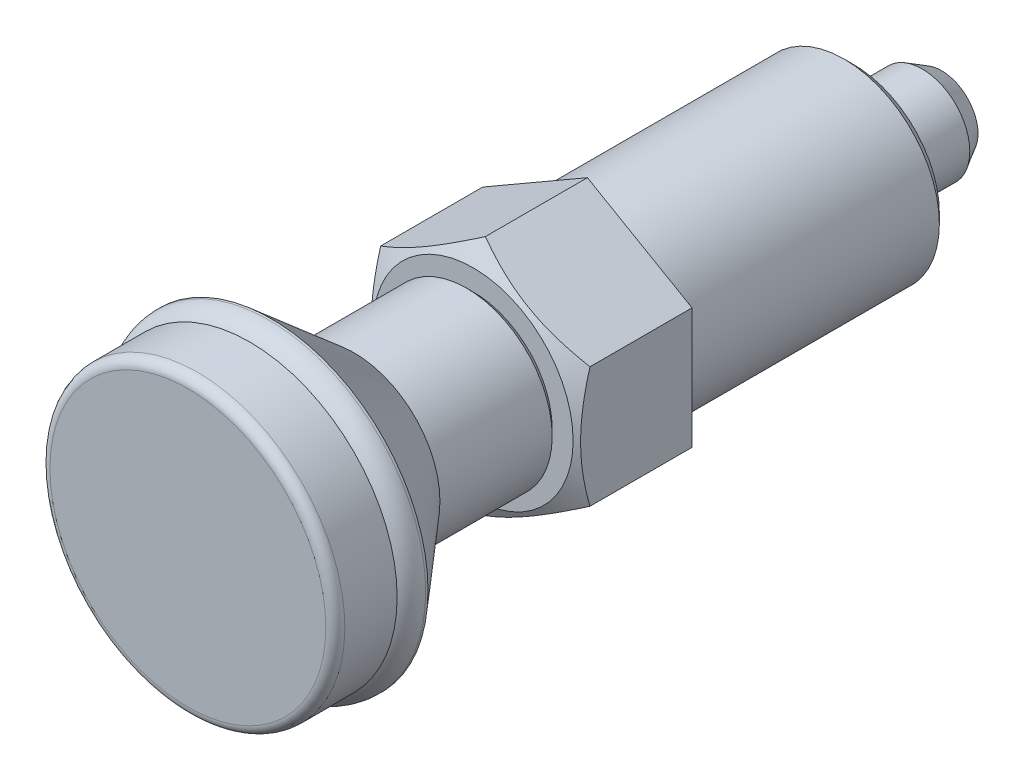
ISO-10303-21;
HEADER;
FILE_DESCRIPTION(('STEP AP214'),'2;1');
FILE_NAME('part.step','',(''),(''),'','','');
FILE_SCHEMA(('AUTOMOTIVE_DESIGN { 1 0 10303 214 1 1 1 1 }'));
ENDSEC;
DATA;
#1=APPLICATION_CONTEXT('core data for automotive mechanical design processes');
#2=APPLICATION_PROTOCOL_DEFINITION('international standard','automotive_design',2000,#1);
#3=PRODUCT_CONTEXT('',#1,'mechanical');
#4=PRODUCT('Part','Part','',(#3));
#5=PRODUCT_RELATED_PRODUCT_CATEGORY('part','',(#4));
#6=PRODUCT_DEFINITION_FORMATION('','',#4);
#7=PRODUCT_DEFINITION_CONTEXT('part definition',#1,'design');
#8=PRODUCT_DEFINITION('design','',#6,#7);
#9=PRODUCT_DEFINITION_SHAPE('','',#8);
#10=(LENGTH_UNIT() NAMED_UNIT(*) SI_UNIT(.MILLI.,.METRE.));
#11=(NAMED_UNIT(*) PLANE_ANGLE_UNIT() SI_UNIT($,.RADIAN.));
#12=(NAMED_UNIT(*) SI_UNIT($,.STERADIAN.) SOLID_ANGLE_UNIT());
#13=UNCERTAINTY_MEASURE_WITH_UNIT(LENGTH_MEASURE(1.E-05),#10,'distance_accuracy_value','');
#14=(GEOMETRIC_REPRESENTATION_CONTEXT(3) GLOBAL_UNCERTAINTY_ASSIGNED_CONTEXT((#13)) GLOBAL_UNIT_ASSIGNED_CONTEXT((#10,
#11,#12)) REPRESENTATION_CONTEXT('',''));
#15=CARTESIAN_POINT('',(0.,0.,0.));
#16=DIRECTION('',(0.,0.,1.));
#17=DIRECTION('',(1.,0.,0.));
#18=AXIS2_PLACEMENT_3D('',#15,#16,#17);
#19=CARTESIAN_POINT('',(-1.94607460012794E-12,1.11855633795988E-12,12.));
#20=DIRECTION('',(1.62172883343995E-13,0.,-1.));
#21=DIRECTION('',(-1.,0.,-1.62172883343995E-13));
#22=AXIS2_PLACEMENT_3D('',#19,#20,#21);
#23=CONICAL_SURFACE('',#22,10.499999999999,1.0471975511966);
#24=CARTESIAN_POINT('',(-1.94607460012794E-12,1.11855633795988E-12,12.));
#25=DIRECTION('',(-1.62172883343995E-13,0.,1.));
#26=DIRECTION('',(1.,0.,1.62172883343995E-13));
#27=AXIS2_PLACEMENT_3D('',#24,#25,#26);
#28=CIRCLE('',#27,10.499999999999);
#29=CARTESIAN_POINT('',(10.4999999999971,1.11855633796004E-12,12.0000000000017));
#30=VERTEX_POINT('',#29);
#31=EDGE_CURVE('E235',#30,#30,#28,.T.);
#32=ORIENTED_EDGE('',*,*,#31,.F.);
#33=EDGE_LOOP('',(#32));
#34=FACE_BOUND('',#33,.T.);
#35=CARTESIAN_POINT('',(11.0001999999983,6.35073749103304,10.7287778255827));
#36=CARTESIAN_POINT('',(10.7583962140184,6.49034297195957,10.8093657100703));
#37=CARTESIAN_POINT('',(10.5156908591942,6.63046897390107,10.8862959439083));
#38=CARTESIAN_POINT('',(10.0283338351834,6.91184468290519,11.031826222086));
#39=CARTESIAN_POINT('',(9.78368155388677,7.05309474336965,11.100423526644));
#40=CARTESIAN_POINT('',(9.04578263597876,7.47912088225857,11.2923885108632));
#41=CARTESIAN_POINT('',(8.5496230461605,7.76557875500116,11.4015771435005));
#42=CARTESIAN_POINT('',(7.80714296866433,8.1942498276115,11.5296107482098));
#43=CARTESIAN_POINT('',(7.56304065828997,8.33518236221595,11.5660826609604));
#44=CARTESIAN_POINT('',(7.07370581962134,8.61769996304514,11.627243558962));
#45=CARTESIAN_POINT('',(6.82847326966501,8.75928504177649,11.6519323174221));
#46=CARTESIAN_POINT('',(6.33759931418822,9.04269125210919,11.688894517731));
#47=CARTESIAN_POINT('',(6.09195874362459,9.184511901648,11.7011827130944));
#48=CARTESIAN_POINT('',(5.60044998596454,9.46828461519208,11.7130819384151));
#49=CARTESIAN_POINT('',(5.35458180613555,9.61023667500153,11.7126933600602));
#50=CARTESIAN_POINT('',(4.89492981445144,9.87561687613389,11.7001236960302));
#51=CARTESIAN_POINT('',(4.68111322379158,9.99906394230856,11.6894758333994));
#52=CARTESIAN_POINT('',(4.25397181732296,10.2456741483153,11.6587932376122));
#53=CARTESIAN_POINT('',(4.04064703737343,10.3688372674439,11.6387578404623));
#54=CARTESIAN_POINT('',(3.61460518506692,10.6148126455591,11.5896494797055));
#55=CARTESIAN_POINT('',(3.40188876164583,10.7376245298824,11.5605690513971));
#56=CARTESIAN_POINT('',(2.97745318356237,10.9826725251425,11.4938808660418));
#57=CARTESIAN_POINT('',(2.76573409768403,11.1049085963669,11.4562725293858));
#58=CARTESIAN_POINT('',(2.12304886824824,11.4759630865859,11.3297049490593));
#59=CARTESIAN_POINT('',(1.69394387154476,11.7237069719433,11.2281254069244));
#60=CARTESIAN_POINT('',(0.842132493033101,12.2155005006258,10.9975811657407));
#61=CARTESIAN_POINT('',(0.419415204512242,12.4595564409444,10.868670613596));
#62=CARTESIAN_POINT('',(-0.000200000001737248,12.7018213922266,10.7287778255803));
#63=B_SPLINE_CURVE_WITH_KNOTS('',3,(#35,#36,#37,#38,#39,#40,#41,#42,#43,#44,#45,#46,#47,#48,#49,
#50,#51,#52,#53,#54,#55,#56,#57,#58,#59,#60,#61,#62),.UNSPECIFIED.,.F.,.F.,(4,2,2,2,2,2,2,2,2,2,
2,2,2,4),(0.,0.8717551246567,1.74379610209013,3.49159027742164,4.34403665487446,
5.19649943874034,6.04794680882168,6.89936787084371,7.64056020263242,8.38180496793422,
9.12366309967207,9.865571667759,11.3820155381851,12.8954827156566),.UNSPECIFIED.);
#64=CARTESIAN_POINT('',(10.9999999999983,6.35085296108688,10.728844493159));
#65=VERTEX_POINT('',#64);
#66=CARTESIAN_POINT('',(0.,12.7017059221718,10.7288444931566));
#67=VERTEX_POINT('',#66);
#68=EDGE_CURVE('E85',#65,#67,#63,.T.);
#69=ORIENTED_EDGE('',*,*,#68,.T.);
#70=CARTESIAN_POINT('',(0.000199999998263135,12.7018213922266,10.7287778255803));
#71=CARTESIAN_POINT('',(-0.241603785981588,12.5622159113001,10.8093657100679));
#72=CARTESIAN_POINT('',(-0.484309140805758,12.4220899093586,10.886295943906));
#73=CARTESIAN_POINT('',(-0.971666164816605,12.1407142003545,11.0318262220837));
#74=CARTESIAN_POINT('',(-1.21631844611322,11.9994641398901,11.1004235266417));
#75=CARTESIAN_POINT('',(-1.95421736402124,11.5734380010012,11.292388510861));
#76=CARTESIAN_POINT('',(-2.4503769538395,11.2869801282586,11.4015771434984));
#77=CARTESIAN_POINT('',(-3.19285703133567,10.8583090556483,11.5296107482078));
#78=CARTESIAN_POINT('',(-3.43695934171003,10.7173765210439,11.5660826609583));
#79=CARTESIAN_POINT('',(-3.92629418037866,10.4348589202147,11.62724355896));
#80=CARTESIAN_POINT('',(-4.17152673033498,10.2932738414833,11.6519323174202));
#81=CARTESIAN_POINT('',(-4.66240068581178,10.0098676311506,11.6888945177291));
#82=CARTESIAN_POINT('',(-4.90804125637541,9.86804698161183,11.7011827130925));
#83=CARTESIAN_POINT('',(-5.39955001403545,9.58427426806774,11.7130819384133));
#84=CARTESIAN_POINT('',(-5.64541819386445,9.44232220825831,11.7126933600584));
#85=CARTESIAN_POINT('',(-6.10507018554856,9.17694200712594,11.7001236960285));
#86=CARTESIAN_POINT('',(-6.31888677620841,9.05349494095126,11.6894758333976));
#87=CARTESIAN_POINT('',(-6.74602818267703,8.80688473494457,11.6587932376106));
#88=CARTESIAN_POINT('',(-6.95935296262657,8.68372161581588,11.6387578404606));
#89=CARTESIAN_POINT('',(-7.38539481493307,8.43774623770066,11.5896494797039));
#90=CARTESIAN_POINT('',(-7.59811123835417,8.31493435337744,11.5605690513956));
#91=CARTESIAN_POINT('',(-8.02254681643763,8.06988635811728,11.4938808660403));
#92=CARTESIAN_POINT('',(-8.23426590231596,7.94765028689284,11.4562725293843));
#93=CARTESIAN_POINT('',(-8.87695113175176,7.57659579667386,11.3297049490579));
#94=CARTESIAN_POINT('',(-9.30605612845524,7.32885191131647,11.2281254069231));
#95=CARTESIAN_POINT('',(-10.1578675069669,6.83705838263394,10.9975811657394));
#96=CARTESIAN_POINT('',(-10.5805847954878,6.59300244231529,10.8686706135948));
#97=CARTESIAN_POINT('',(-11.0002000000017,6.35073749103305,10.7287778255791));
#98=B_SPLINE_CURVE_WITH_KNOTS('',3,(#70,#71,#72,#73,#74,#75,#76,#77,#78,#79,#80,#81,#82,#83,#84,
#85,#86,#87,#88,#89,#90,#91,#92,#93,#94,#95,#96,#97),.UNSPECIFIED.,.F.,.F.,(4,2,2,2,2,2,2,2,2,2,
2,2,2,4),(0.,0.871755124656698,1.74379610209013,3.49159027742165,4.34403665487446,
5.19649943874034,6.04794680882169,6.89936787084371,7.64056020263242,8.38180496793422,
9.12366309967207,9.865571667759,11.3820155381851,12.8954827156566),.UNSPECIFIED.);
#99=CARTESIAN_POINT('',(-11.0000000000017,6.35085296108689,10.7288444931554));
#100=VERTEX_POINT('',#99);
#101=EDGE_CURVE('E75',#67,#100,#98,.T.);
#102=ORIENTED_EDGE('',*,*,#101,.T.);
#103=CARTESIAN_POINT('',(-11.000000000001,-16.8033913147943,6.46686326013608));
#104=CARTESIAN_POINT('',(-11.0000000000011,-16.5620742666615,6.58342928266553));
#105=CARTESIAN_POINT('',(-11.0000000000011,-16.3204643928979,6.6993887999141));
#106=CARTESIAN_POINT('',(-11.0000000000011,-15.8365971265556,6.92995551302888));
#107=CARTESIAN_POINT('',(-11.0000000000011,-15.5943397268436,7.04456269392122));
#108=CARTESIAN_POINT('',(-11.0000000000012,-14.8664318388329,7.38618027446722));
#109=CARTESIAN_POINT('',(-11.0000000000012,-14.3797248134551,7.61094836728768));
#110=CARTESIAN_POINT('',(-11.0000000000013,-13.4001281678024,8.05434060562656));
#111=CARTESIAN_POINT('',(-11.0000000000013,-12.9072190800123,8.27292185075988));
#112=CARTESIAN_POINT('',(-11.0000000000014,-11.9173356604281,8.70064166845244));
#113=CARTESIAN_POINT('',(-11.0000000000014,-11.4203615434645,8.90978073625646));
#114=CARTESIAN_POINT('',(-11.0000000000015,-10.4155733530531,9.31850427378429));
#115=CARTESIAN_POINT('',(-11.0000000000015,-9.90770066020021,9.51794543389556));
#116=CARTESIAN_POINT('',(-11.0000000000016,-8.88595211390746,9.90110782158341));
#117=CARTESIAN_POINT('',(-11.0000000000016,-8.37207559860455,10.0848272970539));
#118=CARTESIAN_POINT('',(-11.0000000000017,-7.33856431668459,10.4315794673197));
#119=CARTESIAN_POINT('',(-11.0000000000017,-6.8189445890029,10.594656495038));
#120=CARTESIAN_POINT('',(-11.0000000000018,-5.77233865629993,10.8948046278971));
#121=CARTESIAN_POINT('',(-11.0000000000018,-5.24535484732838,11.0318839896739));
#122=CARTESIAN_POINT('',(-11.0000000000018,-4.18355667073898,11.2733499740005));
#123=CARTESIAN_POINT('',(-11.0000000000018,-3.64873977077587,11.3777257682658));
#124=CARTESIAN_POINT('',(-11.0000000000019,-2.84184292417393,11.5045125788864));
#125=CARTESIAN_POINT('',(-11.0000000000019,-2.57206571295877,11.5418147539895));
#126=CARTESIAN_POINT('',(-11.0000000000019,-2.03125940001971,11.6057590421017));
#127=CARTESIAN_POINT('',(-11.0000000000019,-1.76023041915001,11.6324021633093));
#128=CARTESIAN_POINT('',(-11.0000000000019,-1.21898438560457,11.6743130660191));
#129=CARTESIAN_POINT('',(-11.0000000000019,-0.948772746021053,11.6896504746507));
#130=CARTESIAN_POINT('',(-11.0000000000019,-0.407943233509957,11.708869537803));
#131=CARTESIAN_POINT('',(-11.0000000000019,-0.137325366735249,11.712751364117));
#132=CARTESIAN_POINT('',(-11.0000000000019,0.40375541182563,11.7089669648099));
#133=CARTESIAN_POINT('',(-11.0000000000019,0.67421834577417,11.7013039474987));
#134=CARTESIAN_POINT('',(-11.0000000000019,1.21458707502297,11.6746193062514));
#135=CARTESIAN_POINT('',(-11.0000000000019,1.48449283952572,11.6555970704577));
#136=CARTESIAN_POINT('',(-11.0000000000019,2.13975155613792,11.5960223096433));
#137=CARTESIAN_POINT('',(-11.0000000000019,2.52459164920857,11.5497180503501));
#138=CARTESIAN_POINT('',(-11.0000000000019,3.29123006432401,11.4366039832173));
#139=CARTESIAN_POINT('',(-11.0000000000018,3.67302792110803,11.3697910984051));
#140=CARTESIAN_POINT('',(-11.0000000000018,4.81453751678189,11.1419434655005));
#141=CARTESIAN_POINT('',(-11.0000000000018,5.56887050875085,10.9536528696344));
#142=CARTESIAN_POINT('',(-11.0000000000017,6.69714810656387,10.6293211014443));
#143=CARTESIAN_POINT('',(-11.0000000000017,7.07699619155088,10.5126543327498));
#144=CARTESIAN_POINT('',(-11.0000000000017,7.83302288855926,10.267770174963));
#145=CARTESIAN_POINT('',(-11.0000000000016,8.20920116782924,10.1395517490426));
#146=CARTESIAN_POINT('',(-11.0000000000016,8.95600996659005,9.87430554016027));
#147=CARTESIAN_POINT('',(-11.0000000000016,9.32665982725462,9.73733166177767));
#148=CARTESIAN_POINT('',(-11.0000000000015,10.0648107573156,9.45550377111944));
#149=CARTESIAN_POINT('',(-11.0000000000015,10.4323128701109,9.31065249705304));
#150=CARTESIAN_POINT('',(-11.0000000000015,10.7984905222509,9.16260110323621));
#151=B_SPLINE_CURVE_WITH_KNOTS('',3,(#103,#104,#105,#106,#107,#108,#109,#110,#111,#112,#113,
#114,#115,#116,#117,#118,#119,#120,#121,#122,#123,#124,#125,#126,#127,#128,#129,#130,#131,#132,
#133,#134,#135,#136,#137,#138,#139,#140,#141,#142,#143,#144,#145,#146,#147,#148,#149,#150),
.UNSPECIFIED.,.F.,.F.,(4,2,2,2,2,2,2,2,2,2,2,2,2,2,2,2,2,2,2,2,2,2,2,4),(0.,0.803984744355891,
1.6079783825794,3.21622949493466,4.83375407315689,6.45119371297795,8.08788018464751,
9.72474882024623,11.3580401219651,12.990811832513,14.6241235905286,15.4409776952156,
16.2577545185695,17.0694581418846,17.8811495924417,18.6926155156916,19.504125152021,
20.6663113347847,21.8286719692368,24.1578810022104,25.3498722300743,26.5419705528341,
27.7273290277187,28.912278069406),.UNSPECIFIED.);
#152=CARTESIAN_POINT('',(-11.0000000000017,-6.35085296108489,10.7288444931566));
#153=VERTEX_POINT('',#152);
#154=EDGE_CURVE('E161',#100,#153,#151,.F.);
#155=ORIENTED_EDGE('',*,*,#154,.T.);
#156=CARTESIAN_POINT('',(-11.0002000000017,-6.35073749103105,10.7287778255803));
#157=CARTESIAN_POINT('',(-10.7583962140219,-6.49034297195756,10.809365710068));
#158=CARTESIAN_POINT('',(-10.5156908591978,-6.63046897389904,10.8862959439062));
#159=CARTESIAN_POINT('',(-10.028333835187,-6.91184468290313,11.031826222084));
#160=CARTESIAN_POINT('',(-9.78368155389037,-7.05309474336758,11.1004235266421));
#161=CARTESIAN_POINT('',(-9.04578263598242,-7.47912088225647,11.2923885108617));
#162=CARTESIAN_POINT('',(-8.5496230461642,-7.76557875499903,11.4015771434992));
#163=CARTESIAN_POINT('',(-7.80714296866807,-8.19424982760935,11.5296107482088));
#164=CARTESIAN_POINT('',(-7.56304065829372,-8.33518236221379,11.5660826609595));
#165=CARTESIAN_POINT('',(-7.07370581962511,-8.61769996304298,11.6272435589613));
#166=CARTESIAN_POINT('',(-6.82847326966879,-8.75928504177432,11.6519323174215));
#167=CARTESIAN_POINT('',(-6.33759931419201,-9.04269125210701,11.6888945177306));
#168=CARTESIAN_POINT('',(-6.09195874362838,-9.18451190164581,11.7011827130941));
#169=CARTESIAN_POINT('',(-5.60044998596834,-9.46828461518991,11.713081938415));
#170=CARTESIAN_POINT('',(-5.35458180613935,-9.61023667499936,11.7126933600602));
#171=CARTESIAN_POINT('',(-4.89492981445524,-9.87561687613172,11.7001236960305));
#172=CARTESIAN_POINT('',(-4.68111322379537,-9.99906394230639,11.6894758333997));
#173=CARTESIAN_POINT('',(-4.25397181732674,-10.2456741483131,11.6587932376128));
#174=CARTESIAN_POINT('',(-4.0406470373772,-10.3688372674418,11.6387578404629));
#175=CARTESIAN_POINT('',(-3.61460518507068,-10.614812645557,11.5896494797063));
#176=CARTESIAN_POINT('',(-3.40188876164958,-10.7376245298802,11.560569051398));
#177=CARTESIAN_POINT('',(-2.97745318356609,-10.9826725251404,11.4938808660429));
#178=CARTESIAN_POINT('',(-2.76573409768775,-11.1049085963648,11.456272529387));
#179=CARTESIAN_POINT('',(-2.12304886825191,-11.4759630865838,11.3297049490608));
#180=CARTESIAN_POINT('',(-1.6939438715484,-11.7237069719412,11.2281254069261));
#181=CARTESIAN_POINT('',(-0.842132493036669,-12.2155005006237,10.9975811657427));
#182=CARTESIAN_POINT('',(-0.419415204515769,-12.4595564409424,10.8686706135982));
#183=CARTESIAN_POINT('',(0.00019999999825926,-12.7018213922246,10.7287778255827));
#184=B_SPLINE_CURVE_WITH_KNOTS('',3,(#156,#157,#158,#159,#160,#161,#162,#163,#164,#165,#166,
#167,#168,#169,#170,#171,#172,#173,#174,#175,#176,#177,#178,#179,#180,#181,#182,#183),
.UNSPECIFIED.,.F.,.F.,(4,2,2,2,2,2,2,2,2,2,2,2,2,4),(0.,0.871755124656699,1.74379610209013,
3.49159027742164,4.34403665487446,5.19649943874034,6.04794680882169,6.89936787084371,
7.64056020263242,8.38180496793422,9.12366309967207,9.865571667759,11.3820155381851,
12.8954827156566),.UNSPECIFIED.);
#185=CARTESIAN_POINT('',(-1.7401725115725E-12,-12.7017059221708,10.728844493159));
#186=VERTEX_POINT('',#185);
#187=EDGE_CURVE('E153',#153,#186,#184,.T.);
#188=ORIENTED_EDGE('',*,*,#187,.T.);
#189=CARTESIAN_POINT('',(-0.000200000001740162,-12.7018213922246,10.7287778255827));
#190=CARTESIAN_POINT('',(0.241603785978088,-12.5622159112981,10.8093657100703));
#191=CARTESIAN_POINT('',(0.484309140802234,-12.4220899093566,10.8862959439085));
#192=CARTESIAN_POINT('',(0.971666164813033,-12.1407142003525,11.0318262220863));
#193=CARTESIAN_POINT('',(1.21631844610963,-11.999464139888,11.1004235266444));
#194=CARTESIAN_POINT('',(1.95421736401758,-11.5734380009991,11.2923885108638));
#195=CARTESIAN_POINT('',(2.4503769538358,-11.2869801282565,11.4015771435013));
#196=CARTESIAN_POINT('',(3.19285703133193,-10.8583090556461,11.5296107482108));
#197=CARTESIAN_POINT('',(3.43695934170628,-10.7173765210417,11.5660826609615));
#198=CARTESIAN_POINT('',(3.92629418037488,-10.4348589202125,11.6272435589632));
#199=CARTESIAN_POINT('',(4.1715267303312,-10.2932738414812,11.6519323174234));
#200=CARTESIAN_POINT('',(4.66240068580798,-10.0098676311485,11.6888945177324));
#201=CARTESIAN_POINT('',(4.90804125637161,-9.86804698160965,11.701182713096));
#202=CARTESIAN_POINT('',(5.39955001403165,-9.58427426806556,11.7130819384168));
#203=CARTESIAN_POINT('',(5.64541819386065,-9.44232220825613,11.712693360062));
#204=CARTESIAN_POINT('',(6.10507018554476,-9.17694200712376,11.7001236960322));
#205=CARTESIAN_POINT('',(6.31888677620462,-9.05349494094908,11.6894758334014));
#206=CARTESIAN_POINT('',(6.74602818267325,-8.80688473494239,11.6587932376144));
#207=CARTESIAN_POINT('',(6.95935296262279,-8.68372161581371,11.6387578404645));
#208=CARTESIAN_POINT('',(7.38539481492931,-8.4377462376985,11.5896494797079));
#209=CARTESIAN_POINT('',(7.59811123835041,-8.31493435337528,11.5605690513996));
#210=CARTESIAN_POINT('',(8.0225468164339,-8.06988635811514,11.4938808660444));
#211=CARTESIAN_POINT('',(8.23426590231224,-7.9476502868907,11.4562725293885));
#212=CARTESIAN_POINT('',(8.87695113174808,-7.57659579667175,11.3297049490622));
#213=CARTESIAN_POINT('',(9.3060561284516,-7.32885191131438,11.2281254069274));
#214=CARTESIAN_POINT('',(10.1578675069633,-6.83705838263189,10.997581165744));
#215=CARTESIAN_POINT('',(10.5805847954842,-6.59300244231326,10.8686706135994));
#216=CARTESIAN_POINT('',(11.0001999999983,-6.35073749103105,10.7287778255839));
#217=B_SPLINE_CURVE_WITH_KNOTS('',3,(#189,#190,#191,#192,#193,#194,#195,#196,#197,#198,#199,
#200,#201,#202,#203,#204,#205,#206,#207,#208,#209,#210,#211,#212,#213,#214,#215,#216),
.UNSPECIFIED.,.F.,.F.,(4,2,2,2,2,2,2,2,2,2,2,2,2,4),(0.,0.871755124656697,1.74379610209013,
3.49159027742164,4.34403665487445,5.19649943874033,6.04794680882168,6.89936787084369,
7.64056020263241,8.38180496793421,9.12366309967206,9.86557166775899,11.3820155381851,
12.8954827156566),.UNSPECIFIED.);
#218=CARTESIAN_POINT('',(10.9999999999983,-6.35085296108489,10.7288444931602));
#219=VERTEX_POINT('',#218);
#220=EDGE_CURVE('E145',#186,#219,#217,.T.);
#221=ORIENTED_EDGE('',*,*,#220,.T.);
#222=CARTESIAN_POINT('',(10.9999999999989,-16.8033913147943,6.46686326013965));
#223=CARTESIAN_POINT('',(10.9999999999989,-16.5620742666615,6.5834292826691));
#224=CARTESIAN_POINT('',(10.9999999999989,-16.3204643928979,6.69938879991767));
#225=CARTESIAN_POINT('',(10.9999999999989,-15.8365971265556,6.92995551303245));
#226=CARTESIAN_POINT('',(10.9999999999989,-15.5943397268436,7.04456269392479));
#227=CARTESIAN_POINT('',(10.9999999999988,-14.8664318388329,7.38618027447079));
#228=CARTESIAN_POINT('',(10.9999999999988,-14.3797248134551,7.61094836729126));
#229=CARTESIAN_POINT('',(10.9999999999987,-13.4001281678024,8.05434060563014));
#230=CARTESIAN_POINT('',(10.9999999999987,-12.9072190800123,8.27292185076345));
#231=CARTESIAN_POINT('',(10.9999999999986,-11.9173356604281,8.70064166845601));
#232=CARTESIAN_POINT('',(10.9999999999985,-11.4203615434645,8.90978073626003));
#233=CARTESIAN_POINT('',(10.9999999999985,-10.4155733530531,9.31850427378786));
#234=CARTESIAN_POINT('',(10.9999999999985,-9.90770066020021,9.51794543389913));
#235=CARTESIAN_POINT('',(10.9999999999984,-8.88595211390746,9.90110782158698));
#236=CARTESIAN_POINT('',(10.9999999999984,-8.37207559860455,10.0848272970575));
#237=CARTESIAN_POINT('',(10.9999999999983,-7.33856431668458,10.4315794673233));
#238=CARTESIAN_POINT('',(10.9999999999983,-6.81894458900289,10.5946564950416));
#239=CARTESIAN_POINT('',(10.9999999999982,-5.77233865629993,10.8948046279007));
#240=CARTESIAN_POINT('',(10.9999999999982,-5.24535484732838,11.0318839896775));
#241=CARTESIAN_POINT('',(10.9999999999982,-4.18355667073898,11.2733499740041));
#242=CARTESIAN_POINT('',(10.9999999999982,-3.64873977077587,11.3777257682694));
#243=CARTESIAN_POINT('',(10.9999999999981,-2.84184292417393,11.50451257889));
#244=CARTESIAN_POINT('',(10.9999999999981,-2.57206571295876,11.5418147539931));
#245=CARTESIAN_POINT('',(10.9999999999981,-2.03125940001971,11.6057590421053));
#246=CARTESIAN_POINT('',(10.9999999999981,-1.76023041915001,11.6324021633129));
#247=CARTESIAN_POINT('',(10.9999999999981,-1.21898438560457,11.6743130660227));
#248=CARTESIAN_POINT('',(10.9999999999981,-0.948772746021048,11.6896504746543));
#249=CARTESIAN_POINT('',(10.9999999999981,-0.407943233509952,11.7088695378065));
#250=CARTESIAN_POINT('',(10.9999999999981,-0.137325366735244,11.7127513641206));
#251=CARTESIAN_POINT('',(10.9999999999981,0.403755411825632,11.7089669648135));
#252=CARTESIAN_POINT('',(10.9999999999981,0.674218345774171,11.7013039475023));
#253=CARTESIAN_POINT('',(10.9999999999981,1.21458707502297,11.674619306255));
#254=CARTESIAN_POINT('',(10.9999999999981,1.48449283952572,11.6555970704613));
#255=CARTESIAN_POINT('',(10.9999999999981,2.13975155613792,11.5960223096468));
#256=CARTESIAN_POINT('',(10.9999999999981,2.52459164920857,11.5497180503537));
#257=CARTESIAN_POINT('',(10.9999999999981,3.29123006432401,11.4366039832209));
#258=CARTESIAN_POINT('',(10.9999999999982,3.67302792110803,11.3697910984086));
#259=CARTESIAN_POINT('',(10.9999999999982,4.81453751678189,11.1419434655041));
#260=CARTESIAN_POINT('',(10.9999999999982,5.56887050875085,10.953652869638));
#261=CARTESIAN_POINT('',(10.9999999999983,6.69714810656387,10.6293211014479));
#262=CARTESIAN_POINT('',(10.9999999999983,7.07699619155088,10.5126543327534));
#263=CARTESIAN_POINT('',(10.9999999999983,7.83302288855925,10.2677701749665));
#264=CARTESIAN_POINT('',(10.9999999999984,8.20920116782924,10.1395517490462));
#265=CARTESIAN_POINT('',(10.9999999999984,8.95600996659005,9.87430554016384));
#266=CARTESIAN_POINT('',(10.9999999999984,9.32665982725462,9.73733166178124));
#267=CARTESIAN_POINT('',(10.9999999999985,10.0648107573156,9.45550377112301));
#268=CARTESIAN_POINT('',(10.9999999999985,10.4323128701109,9.31065249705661));
#269=CARTESIAN_POINT('',(10.9999999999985,10.7984905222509,9.16260110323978));
#270=B_SPLINE_CURVE_WITH_KNOTS('',3,(#222,#223,#224,#225,#226,#227,#228,#229,#230,#231,#232,
#233,#234,#235,#236,#237,#238,#239,#240,#241,#242,#243,#244,#245,#246,#247,#248,#249,#250,#251,
#252,#253,#254,#255,#256,#257,#258,#259,#260,#261,#262,#263,#264,#265,#266,#267,#268,#269),
.UNSPECIFIED.,.F.,.F.,(4,2,2,2,2,2,2,2,2,2,2,2,2,2,2,2,2,2,2,2,2,2,2,4),(0.,0.803984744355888,
1.6079783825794,3.21622949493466,4.83375407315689,6.45119371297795,8.08788018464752,
9.72474882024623,11.3580401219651,12.990811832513,14.6241235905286,15.4409776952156,
16.2577545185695,17.0694581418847,17.8811495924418,18.6926155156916,19.504125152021,
20.6663113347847,21.8286719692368,24.1578810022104,25.3498722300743,26.5419705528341,
27.7273290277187,28.912278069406),.UNSPECIFIED.);
#271=EDGE_CURVE('E120',#219,#65,#270,.T.);
#272=ORIENTED_EDGE('',*,*,#271,.T.);
#273=EDGE_LOOP('',(#69,#102,#155,#188,#221,#272));
#274=FACE_BOUND('',#273,.T.);
#275=ADVANCED_FACE('F15',(#34,#274),#23,.T.);
#276=CARTESIAN_POINT('',(-5.43279159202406E-12,3.12263644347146E-12,33.5000000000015));
#277=DIRECTION('',(-1.62172883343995E-13,0.,1.));
#278=DIRECTION('',(1.,0.,1.62172883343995E-13));
#279=AXIS2_PLACEMENT_3D('',#276,#277,#278);
#280=TOROIDAL_SURFACE('',#279,14.0000000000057,2.49999999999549);
#281=CARTESIAN_POINT('',(-5.43279212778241E-12,3.12263675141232E-12,33.5000033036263));
#282=DIRECTION('',(-1.62172883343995E-13,0.,1.));
#283=DIRECTION('',(1.,0.,1.62172883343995E-13));
#284=AXIS2_PLACEMENT_3D('',#281,#282,#283);
#285=CIRCLE('',#284,16.499999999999);
#286=CARTESIAN_POINT('',(16.4999999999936,3.12263675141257E-12,33.5000033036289));
#287=VERTEX_POINT('',#286);
#288=EDGE_CURVE('E9',#287,#287,#285,.T.);
#289=ORIENTED_EDGE('',*,*,#288,.T.);
#290=EDGE_LOOP('',(#289));
#291=FACE_BOUND('',#290,.T.);
#292=CARTESIAN_POINT('',(-5.75713735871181E-12,3.30906249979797E-12,35.5));
#293=DIRECTION('',(-1.62172883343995E-13,0.,1.));
#294=DIRECTION('',(1.,0.,1.62172883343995E-13));
#295=AXIS2_PLACEMENT_3D('',#292,#293,#294);
#296=CIRCLE('',#295,15.5);
#297=CARTESIAN_POINT('',(15.4999999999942,3.3090624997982E-12,35.5000000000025));
#298=VERTEX_POINT('',#297);
#299=EDGE_CURVE('E256',#298,#298,#296,.T.);
#300=ORIENTED_EDGE('',*,*,#299,.F.);
#301=EDGE_LOOP('',(#300));
#302=FACE_BOUND('',#301,.T.);
#303=ADVANCED_FACE('F17',(#291,#302),#280,.T.);
#304=CARTESIAN_POINT('',(-6.81126110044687E-12,3.91494718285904E-12,41.9999999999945));
#305=DIRECTION('',(-1.62172883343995E-13,0.,1.));
#306=DIRECTION('',(1.,0.,1.62172883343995E-13));
#307=AXIS2_PLACEMENT_3D('',#304,#305,#306);
#308=CYLINDRICAL_SURFACE('',#307,16.499999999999);
#309=CARTESIAN_POINT('',(-5.39270831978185E-12,3.09959755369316E-12,33.2528361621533));
#310=DIRECTION('',(-1.62172883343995E-13,0.,1.));
#311=DIRECTION('',(1.,0.,1.62172883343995E-13));
#312=AXIS2_PLACEMENT_3D('',#309,#310,#311);
#313=CIRCLE('',#312,16.499999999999);
#314=CARTESIAN_POINT('',(16.4999999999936,3.0995975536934E-12,33.252836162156));
#315=VERTEX_POINT('',#314);
#316=EDGE_CURVE('E24',#315,#315,#313,.T.);
#317=ORIENTED_EDGE('',*,*,#316,.T.);
#318=EDGE_LOOP('',(#317));
#319=FACE_BOUND('',#318,.T.);
#320=ORIENTED_EDGE('',*,*,#288,.F.);
#321=EDGE_LOOP('',(#320));
#322=FACE_BOUND('',#321,.T.);
#323=ADVANCED_FACE('F230',(#319,#322),#308,.T.);
#324=CARTESIAN_POINT('',(-5.39270831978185E-12,3.09959755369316E-12,33.2528361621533));
#325=DIRECTION('',(-1.62172883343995E-13,0.,1.));
#326=DIRECTION('',(1.,0.,1.62172883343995E-13));
#327=AXIS2_PLACEMENT_3D('',#324,#325,#326);
#328=CONICAL_SURFACE('',#327,16.499999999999,0.708466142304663);
#329=CARTESIAN_POINT('',(-3.97323564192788E-12,2.28371919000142E-12,24.5));
#330=DIRECTION('',(-1.62172883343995E-13,0.,1.));
#331=DIRECTION('',(1.,0.,1.62172883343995E-13));
#332=AXIS2_PLACEMENT_3D('',#329,#330,#331);
#333=CIRCLE('',#332,8.99999999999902);
#334=CARTESIAN_POINT('',(8.99999999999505,2.28371919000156E-12,24.5000000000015));
#335=VERTEX_POINT('',#334);
#336=EDGE_CURVE('E299',#335,#335,#333,.T.);
#337=ORIENTED_EDGE('',*,*,#336,.T.);
#338=EDGE_LOOP('',(#337));
#339=FACE_BOUND('',#338,.T.);
#340=ORIENTED_EDGE('',*,*,#316,.F.);
#341=EDGE_LOOP('',(#340));
#342=FACE_BOUND('',#341,.T.);
#343=ADVANCED_FACE('F309',(#339,#342),#328,.T.);
#344=CARTESIAN_POINT('',(-6.81126110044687E-12,3.91494718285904E-12,41.9999999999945));
#345=DIRECTION('',(-1.62172883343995E-13,0.,1.));
#346=DIRECTION('',(1.,0.,1.62172883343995E-13));
#347=AXIS2_PLACEMENT_3D('',#344,#345,#346);
#348=CYLINDRICAL_SURFACE('',#347,8.99999999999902);
#349=CARTESIAN_POINT('',(-2.05959561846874E-12,1.1838054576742E-12,12.7));
#350=DIRECTION('',(-1.62172883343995E-13,0.,1.));
#351=DIRECTION('',(1.,0.,1.62172883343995E-13));
#352=AXIS2_PLACEMENT_3D('',#349,#350,#351);
#353=CIRCLE('',#352,8.99999999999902);
#354=CARTESIAN_POINT('',(8.99999999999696,1.18380545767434E-12,12.7000000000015));
#355=VERTEX_POINT('',#354);
#356=EDGE_CURVE('E295',#355,#355,#353,.T.);
#357=ORIENTED_EDGE('',*,*,#356,.T.);
#358=EDGE_LOOP('',(#357));
#359=FACE_BOUND('',#358,.T.);
#360=ORIENTED_EDGE('',*,*,#336,.F.);
#361=EDGE_LOOP('',(#360));
#362=FACE_BOUND('',#361,.T.);
#363=ADVANCED_FACE('F311',(#359,#362),#348,.T.);
#364=CARTESIAN_POINT('',(-2.05959561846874E-12,1.1838054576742E-12,12.7));
#365=DIRECTION('',(-1.62172883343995E-13,0.,1.));
#366=DIRECTION('',(1.,0.,1.62172883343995E-13));
#367=AXIS2_PLACEMENT_3D('',#364,#365,#366);
#368=CONICAL_SURFACE('',#367,8.99999999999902,0.785398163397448);
#369=CARTESIAN_POINT('',(-1.94607460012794E-12,1.11855633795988E-12,12.));
#370=DIRECTION('',(-1.62172883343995E-13,0.,1.));
#371=DIRECTION('',(1.,0.,1.62172883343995E-13));
#372=AXIS2_PLACEMENT_3D('',#369,#370,#371);
#373=CIRCLE('',#372,8.29999999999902);
#374=CARTESIAN_POINT('',(8.29999999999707,1.11855633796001E-12,12.0000000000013));
#375=VERTEX_POINT('',#374);
#376=EDGE_CURVE('E291',#375,#375,#373,.T.);
#377=ORIENTED_EDGE('',*,*,#376,.T.);
#378=EDGE_LOOP('',(#377));
#379=FACE_BOUND('',#378,.T.);
#380=ORIENTED_EDGE('',*,*,#356,.F.);
#381=EDGE_LOOP('',(#380));
#382=FACE_BOUND('',#381,.T.);
#383=ADVANCED_FACE('F319',(#379,#382),#368,.T.);
#384=CARTESIAN_POINT('',(-1.94607460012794E-12,10.5000000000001,11.9999999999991));
#385=DIRECTION('',(-1.62172883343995E-13,0.,1.));
#386=DIRECTION('',(1.,0.,1.62172883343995E-13));
#387=AXIS2_PLACEMENT_3D('',#384,#385,#386);
#388=PLANE('',#387);
#389=ORIENTED_EDGE('',*,*,#31,.T.);
#390=EDGE_LOOP('',(#389));
#391=FACE_BOUND('',#390,.T.);
#392=ORIENTED_EDGE('',*,*,#376,.F.);
#393=EDGE_LOOP('',(#392));
#394=FACE_BOUND('',#393,.T.);
#395=ADVANCED_FACE('F193',(#391,#394),#388,.T.);
#396=CARTESIAN_POINT('',(-6.81126110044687E-12,3.91494718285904E-12,41.9999999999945));
#397=DIRECTION('',(-1.62172883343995E-13,0.,1.));
#398=DIRECTION('',(1.,0.,1.62172883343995E-13));
#399=AXIS2_PLACEMENT_3D('',#396,#397,#398);
#400=PLANE('',#399);
#401=CARTESIAN_POINT('',(-6.81126110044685E-12,3.91494718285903E-12,41.9999999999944));
#402=DIRECTION('',(-1.62172883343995E-13,0.,1.));
#403=DIRECTION('',(1.,0.,1.62172883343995E-13));
#404=AXIS2_PLACEMENT_3D('',#401,#402,#403);
#405=CIRCLE('',#404,14.5);
#406=CARTESIAN_POINT('',(14.4999999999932,3.91494718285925E-12,41.9999999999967));
#407=VERTEX_POINT('',#406);
#408=EDGE_CURVE('E262',#407,#407,#405,.T.);
#409=ORIENTED_EDGE('',*,*,#408,.T.);
#410=EDGE_LOOP('',(#409));
#411=FACE_BOUND('',#410,.T.);
#412=ADVANCED_FACE('F189',(#411),#400,.T.);
#413=CARTESIAN_POINT('',(-6.64908821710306E-12,3.82173415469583E-12,40.9999999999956));
#414=DIRECTION('',(-1.62172883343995E-13,0.,1.));
#415=DIRECTION('',(1.,0.,1.62172883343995E-13));
#416=AXIS2_PLACEMENT_3D('',#413,#414,#415);
#417=TOROIDAL_SURFACE('',#416,14.5000000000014,0.999999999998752);
#418=CARTESIAN_POINT('',(-6.64908821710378E-12,3.82173415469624E-12,41.));
#419=DIRECTION('',(-1.62172883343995E-13,0.,1.));
#420=DIRECTION('',(1.,0.,1.62172883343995E-13));
#421=AXIS2_PLACEMENT_3D('',#418,#419,#420);
#422=CIRCLE('',#421,15.5);
#423=CARTESIAN_POINT('',(15.4999999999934,3.82173415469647E-12,41.0000000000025));
#424=VERTEX_POINT('',#423);
#425=EDGE_CURVE('E259',#424,#424,#422,.T.);
#426=ORIENTED_EDGE('',*,*,#425,.T.);
#427=EDGE_LOOP('',(#426));
#428=FACE_BOUND('',#427,.T.);
#429=ORIENTED_EDGE('',*,*,#408,.F.);
#430=EDGE_LOOP('',(#429));
#431=FACE_BOUND('',#430,.T.);
#432=ADVANCED_FACE('F185',(#428,#431),#417,.T.);
#433=CARTESIAN_POINT('',(-6.81126110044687E-12,3.91494718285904E-12,41.9999999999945));
#434=DIRECTION('',(-1.62172883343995E-13,0.,1.));
#435=DIRECTION('',(1.,0.,1.62172883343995E-13));
#436=AXIS2_PLACEMENT_3D('',#433,#434,#435);
#437=CYLINDRICAL_SURFACE('',#436,15.5);
#438=ORIENTED_EDGE('',*,*,#299,.T.);
#439=EDGE_LOOP('',(#438));
#440=FACE_BOUND('',#439,.T.);
#441=ORIENTED_EDGE('',*,*,#425,.F.);
#442=EDGE_LOOP('',(#441));
#443=FACE_BOUND('',#442,.T.);
#444=ADVANCED_FACE('F182',(#440,#443),#437,.T.);
#445=CARTESIAN_POINT('',(-11.0000000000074,6.35085296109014,45.6055550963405));
#446=DIRECTION('',(-0.5,0.866025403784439,-1.61811292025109E-13));
#447=DIRECTION('',(-0.866025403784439,-0.5,0.));
#448=AXIS2_PLACEMENT_3D('',#445,#446,#447);
#449=PLANE('',#448);
#450=DIRECTION('',(1.62172883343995E-13,0.,-1.));
#451=VECTOR('',#450,1.);
#452=CARTESIAN_POINT('',(-7.39251491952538E-12,12.701705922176,45.6055550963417));
#453=LINE('',#452,#451);
#454=CARTESIAN_POINT('',(0.,12.7017059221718,-1.18655085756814E-12));
#455=VERTEX_POINT('',#454);
#456=EDGE_CURVE('E31',#67,#455,#453,.T.);
#457=ORIENTED_EDGE('',*,*,#456,.T.);
#458=DIRECTION('',(0.866025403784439,0.5,0.));
#459=VECTOR('',#458,1.);
#460=CARTESIAN_POINT('',(-11.,6.35085296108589,-2.37310171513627E-12));
#461=LINE('',#460,#459);
#462=CARTESIAN_POINT('',(-11.,6.35085296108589,-2.37310171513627E-12));
#463=VERTEX_POINT('',#462);
#464=EDGE_CURVE('E72',#463,#455,#461,.T.);
#465=ORIENTED_EDGE('',*,*,#464,.F.);
#466=DIRECTION('',(1.62172883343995E-13,0.,-1.));
#467=VECTOR('',#466,1.);
#468=CARTESIAN_POINT('',(-11.0000000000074,6.35085296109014,45.6055550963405));
#469=LINE('',#468,#467);
#470=EDGE_CURVE('E93',#100,#463,#469,.T.);
#471=ORIENTED_EDGE('',*,*,#470,.F.);
#472=ORIENTED_EDGE('',*,*,#101,.F.);
#473=EDGE_LOOP('',(#457,#465,#471,#472));
#474=FACE_BOUND('',#473,.T.);
#475=ADVANCED_FACE('F69',(#474),#449,.T.);
#476=CARTESIAN_POINT('',(-11.0000000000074,-6.35085296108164,45.6055550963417));
#477=DIRECTION('',(-1.,0.,-1.62172883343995E-13));
#478=DIRECTION('',(-1.62172883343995E-13,0.,1.));
#479=AXIS2_PLACEMENT_3D('',#476,#477,#478);
#480=PLANE('',#479);
#481=ORIENTED_EDGE('',*,*,#470,.T.);
#482=DIRECTION('',(0.,1.,0.));
#483=VECTOR('',#482,1.);
#484=CARTESIAN_POINT('',(-11.,-6.35085296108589,-1.19348975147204E-12));
#485=LINE('',#484,#483);
#486=CARTESIAN_POINT('',(-11.,-6.35085296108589,-1.19348975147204E-12));
#487=VERTEX_POINT('',#486);
#488=EDGE_CURVE('E90',#487,#463,#485,.T.);
#489=ORIENTED_EDGE('',*,*,#488,.F.);
#490=DIRECTION('',(1.62172883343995E-13,0.,-1.));
#491=VECTOR('',#490,1.);
#492=CARTESIAN_POINT('',(-11.0000000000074,-6.35085296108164,45.6055550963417));
#493=LINE('',#492,#491);
#494=EDGE_CURVE('E92',#153,#487,#493,.T.);
#495=ORIENTED_EDGE('',*,*,#494,.F.);
#496=ORIENTED_EDGE('',*,*,#154,.F.);
#497=EDGE_LOOP('',(#481,#489,#495,#496));
#498=FACE_BOUND('',#497,.T.);
#499=ADVANCED_FACE('F175',(#498),#480,.T.);
#500=CARTESIAN_POINT('',(-7.39622923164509E-12,-12.7017059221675,45.6055550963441));
#501=DIRECTION('',(-0.5,-0.866025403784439,0.));
#502=DIRECTION('',(0.866025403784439,-0.5,1.87052350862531E-13));
#503=AXIS2_PLACEMENT_3D('',#500,#501,#502);
#504=PLANE('',#503);
#505=ORIENTED_EDGE('',*,*,#494,.T.);
#506=DIRECTION('',(-0.866025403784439,0.5,-1.87052350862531E-13));
#507=VECTOR('',#506,1.);
#508=CARTESIAN_POINT('',(0.,-12.7017059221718,1.18655085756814E-12));
#509=LINE('',#508,#507);
#510=CARTESIAN_POINT('',(0.,-12.7017059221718,1.18655085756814E-12));
#511=VERTEX_POINT('',#510);
#512=EDGE_CURVE('E105',#511,#487,#509,.T.);
#513=ORIENTED_EDGE('',*,*,#512,.F.);
#514=DIRECTION('',(1.62172883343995E-13,0.,-1.));
#515=VECTOR('',#514,1.);
#516=CARTESIAN_POINT('',(-7.39622923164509E-12,-12.7017059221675,45.6055550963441));
#517=LINE('',#516,#515);
#518=EDGE_CURVE('E102',#186,#511,#517,.T.);
#519=ORIENTED_EDGE('',*,*,#518,.F.);
#520=ORIENTED_EDGE('',*,*,#187,.F.);
#521=EDGE_LOOP('',(#505,#513,#519,#520));
#522=FACE_BOUND('',#521,.T.);
#523=ADVANCED_FACE('F141',(#522),#504,.T.);
#524=CARTESIAN_POINT('',(10.9999999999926,-6.35085296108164,45.6055550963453));
#525=DIRECTION('',(0.5,-0.866025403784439,1.61811292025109E-13));
#526=DIRECTION('',(0.866025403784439,0.5,0.));
#527=AXIS2_PLACEMENT_3D('',#524,#525,#526);
#528=PLANE('',#527);
#529=ORIENTED_EDGE('',*,*,#518,.T.);
#530=DIRECTION('',(-0.866025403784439,-0.5,0.));
#531=VECTOR('',#530,1.);
#532=CARTESIAN_POINT('',(11.,-6.35085296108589,2.37310171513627E-12));
#533=LINE('',#532,#531);
#534=CARTESIAN_POINT('',(11.,-6.35085296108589,2.37310171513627E-12));
#535=VERTEX_POINT('',#534);
#536=EDGE_CURVE('E109',#535,#511,#533,.T.);
#537=ORIENTED_EDGE('',*,*,#536,.F.);
#538=DIRECTION('',(1.62172883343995E-13,0.,-1.));
#539=VECTOR('',#538,1.);
#540=CARTESIAN_POINT('',(10.9999999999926,-6.35085296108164,45.6055550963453));
#541=LINE('',#540,#539);
#542=EDGE_CURVE('E106',#219,#535,#541,.T.);
#543=ORIENTED_EDGE('',*,*,#542,.F.);
#544=ORIENTED_EDGE('',*,*,#220,.F.);
#545=EDGE_LOOP('',(#529,#537,#543,#544));
#546=FACE_BOUND('',#545,.T.);
#547=ADVANCED_FACE('F137',(#546),#528,.T.);
#548=CARTESIAN_POINT('',(10.9999999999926,6.35085296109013,45.6055550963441));
#549=DIRECTION('',(1.,0.,1.62172883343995E-13));
#550=DIRECTION('',(0.,1.,0.));
#551=AXIS2_PLACEMENT_3D('',#548,#549,#550);
#552=PLANE('',#551);
#553=ORIENTED_EDGE('',*,*,#542,.T.);
#554=DIRECTION('',(0.,-1.,0.));
#555=VECTOR('',#554,1.);
#556=CARTESIAN_POINT('',(11.,6.35085296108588,1.19348975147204E-12));
#557=LINE('',#556,#555);
#558=CARTESIAN_POINT('',(10.9999999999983,6.35085296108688,1.19348975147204E-12));
#559=VERTEX_POINT('',#558);
#560=EDGE_CURVE('E39',#559,#535,#557,.T.);
#561=ORIENTED_EDGE('',*,*,#560,.F.);
#562=DIRECTION('',(1.62172883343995E-13,0.,-1.));
#563=VECTOR('',#562,1.);
#564=CARTESIAN_POINT('',(10.9999999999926,6.35085296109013,45.6055550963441));
#565=LINE('',#564,#563);
#566=EDGE_CURVE('E82',#65,#559,#565,.T.);
#567=ORIENTED_EDGE('',*,*,#566,.F.);
#568=ORIENTED_EDGE('',*,*,#271,.F.);
#569=EDGE_LOOP('',(#553,#561,#567,#568));
#570=FACE_BOUND('',#569,.T.);
#571=ADVANCED_FACE('F133',(#570),#552,.T.);
#572=CARTESIAN_POINT('',(-7.39251491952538E-12,12.701705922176,45.6055550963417));
#573=DIRECTION('',(0.5,0.866025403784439,0.));
#574=DIRECTION('',(-0.866025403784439,0.5,-1.87052350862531E-13));
#575=AXIS2_PLACEMENT_3D('',#572,#573,#574);
#576=PLANE('',#575);
#577=ORIENTED_EDGE('',*,*,#566,.T.);
#578=DIRECTION('',(0.866025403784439,-0.5,1.87052350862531E-13));
#579=VECTOR('',#578,1.);
#580=CARTESIAN_POINT('',(0.,12.7017059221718,-1.18655085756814E-12));
#581=LINE('',#580,#579);
#582=EDGE_CURVE('E78',#455,#559,#581,.T.);
#583=ORIENTED_EDGE('',*,*,#582,.F.);
#584=ORIENTED_EDGE('',*,*,#456,.F.);
#585=ORIENTED_EDGE('',*,*,#68,.F.);
#586=EDGE_LOOP('',(#577,#583,#584,#585));
#587=FACE_BOUND('',#586,.T.);
#588=ADVANCED_FACE('F81',(#587),#576,.T.);
#589=CARTESIAN_POINT('',(4.54084073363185E-12,-2.60996478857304E-12,-28.));
#590=DIRECTION('',(-1.62172883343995E-13,0.,1.));
#591=DIRECTION('',(0.,1.,0.));
#592=AXIS2_PLACEMENT_3D('',#589,#590,#591);
#593=SPHERICAL_SURFACE('',#592,9.99999999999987);
#594=CARTESIAN_POINT('',(6.03946971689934E-12,-3.47134027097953E-12,-37.2409344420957));
#595=DIRECTION('',(-1.62172883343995E-13,0.,1.));
#596=DIRECTION('',(1.,0.,1.62172883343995E-13));
#597=AXIS2_PLACEMENT_3D('',#594,#595,#596);
#598=CIRCLE('',#597,3.82166595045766);
#599=CARTESIAN_POINT('',(3.82166595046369,-3.47134027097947E-12,-37.2409344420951));
#600=VERTEX_POINT('',#599);
#601=EDGE_CURVE('E266',#600,#600,#598,.T.);
#602=ORIENTED_EDGE('',*,*,#601,.F.);
#603=EDGE_LOOP('',(#602));
#604=FACE_BOUND('',#603,.T.);
#605=ADVANCED_FACE('F132',(#604),#593,.T.);
#606=CARTESIAN_POINT('',(5.70848549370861E-12,-3.28109859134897E-12,-35.2));
#607=DIRECTION('',(-1.62172883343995E-13,0.,1.));
#608=DIRECTION('',(1.,0.,1.62172883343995E-13));
#609=AXIS2_PLACEMENT_3D('',#606,#607,#608);
#610=CONICAL_SURFACE('',#609,5.,0.523598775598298);
#611=ORIENTED_EDGE('',*,*,#601,.T.);
#612=EDGE_LOOP('',(#611));
#613=FACE_BOUND('',#612,.T.);
#614=CARTESIAN_POINT('',(5.70848549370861E-12,-3.28109859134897E-12,-35.2));
#615=DIRECTION('',(-1.62172883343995E-13,0.,1.));
#616=DIRECTION('',(1.,0.,1.62172883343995E-13));
#617=AXIS2_PLACEMENT_3D('',#614,#615,#616);
#618=CIRCLE('',#617,5.);
#619=CARTESIAN_POINT('',(5.00000000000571,-3.28109859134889E-12,-35.1999999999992));
#620=VERTEX_POINT('',#619);
#621=EDGE_CURVE('E270',#620,#620,#618,.T.);
#622=ORIENTED_EDGE('',*,*,#621,.F.);
#623=EDGE_LOOP('',(#622));
#624=FACE_BOUND('',#623,.T.);
#625=ADVANCED_FACE('F197',(#613,#624),#610,.T.);
#626=CARTESIAN_POINT('',(-6.81126110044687E-12,3.91494718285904E-12,41.9999999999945));
#627=DIRECTION('',(-1.62172883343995E-13,0.,1.));
#628=DIRECTION('',(1.,0.,1.62172883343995E-13));
#629=AXIS2_PLACEMENT_3D('',#626,#627,#628);
#630=CYLINDRICAL_SURFACE('',#629,5.);
#631=ORIENTED_EDGE('',*,*,#621,.T.);
#632=EDGE_LOOP('',(#631));
#633=FACE_BOUND('',#632,.T.);
#634=CARTESIAN_POINT('',(4.54084073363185E-12,-2.60996478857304E-12,-28.));
#635=DIRECTION('',(-1.62172883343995E-13,0.,1.));
#636=DIRECTION('',(1.,0.,1.62172883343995E-13));
#637=AXIS2_PLACEMENT_3D('',#634,#635,#636);
#638=CIRCLE('',#637,5.);
#639=CARTESIAN_POINT('',(5.00000000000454,-2.60996478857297E-12,-27.9999999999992));
#640=VERTEX_POINT('',#639);
#641=EDGE_CURVE('E274',#640,#640,#638,.T.);
#642=ORIENTED_EDGE('',*,*,#641,.F.);
#643=EDGE_LOOP('',(#642));
#644=FACE_BOUND('',#643,.T.);
#645=ADVANCED_FACE('F201',(#633,#644),#630,.T.);
#646=CARTESIAN_POINT('',(4.54084073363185E-12,4.99999999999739,-28.0000000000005));
#647=DIRECTION('',(1.62172883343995E-13,0.,-1.));
#648=DIRECTION('',(-1.,0.,-1.62172883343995E-13));
#649=AXIS2_PLACEMENT_3D('',#646,#647,#648);
#650=PLANE('',#649);
#651=ORIENTED_EDGE('',*,*,#641,.T.);
#652=EDGE_LOOP('',(#651));
#653=FACE_BOUND('',#652,.T.);
#654=CARTESIAN_POINT('',(4.54084073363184E-12,-2.60996478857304E-12,-28.));
#655=DIRECTION('',(-1.62172883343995E-13,0.,1.));
#656=DIRECTION('',(1.,0.,1.62172883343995E-13));
#657=AXIS2_PLACEMENT_3D('',#654,#655,#656);
#658=CIRCLE('',#657,9.);
#659=CARTESIAN_POINT('',(9.00000000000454,-2.6099647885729E-12,-27.9999999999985));
#660=VERTEX_POINT('',#659);
#661=EDGE_CURVE('E278',#660,#660,#658,.T.);
#662=ORIENTED_EDGE('',*,*,#661,.F.);
#663=EDGE_LOOP('',(#662));
#664=FACE_BOUND('',#663,.T.);
#665=ADVANCED_FACE('F205',(#653,#664),#650,.T.);
#666=CARTESIAN_POINT('',(4.37866785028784E-12,-2.51675176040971E-12,-27.));
#667=DIRECTION('',(-1.62172883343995E-13,0.,1.));
#668=DIRECTION('',(1.,0.,1.62172883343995E-13));
#669=AXIS2_PLACEMENT_3D('',#666,#667,#668);
#670=CONICAL_SURFACE('',#669,10.,0.785398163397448);
#671=ORIENTED_EDGE('',*,*,#661,.T.);
#672=EDGE_LOOP('',(#671));
#673=FACE_BOUND('',#672,.T.);
#674=CARTESIAN_POINT('',(4.37866785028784E-12,-2.51675176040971E-12,-27.));
#675=DIRECTION('',(-1.62172883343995E-13,0.,1.));
#676=DIRECTION('',(1.,0.,1.62172883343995E-13));
#677=AXIS2_PLACEMENT_3D('',#674,#675,#676);
#678=CIRCLE('',#677,10.);
#679=CARTESIAN_POINT('',(10.0000000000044,-2.51675176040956E-12,-26.9999999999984));
#680=VERTEX_POINT('',#679);
#681=EDGE_CURVE('E282',#680,#680,#678,.T.);
#682=ORIENTED_EDGE('',*,*,#681,.F.);
#683=EDGE_LOOP('',(#682));
#684=FACE_BOUND('',#683,.T.);
#685=ADVANCED_FACE('F209',(#673,#684),#670,.T.);
#686=CARTESIAN_POINT('',(-6.81126110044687E-12,3.91494718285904E-12,41.9999999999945));
#687=DIRECTION('',(-1.62172883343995E-13,0.,1.));
#688=DIRECTION('',(1.,0.,1.62172883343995E-13));
#689=AXIS2_PLACEMENT_3D('',#686,#687,#688);
#690=CYLINDRICAL_SURFACE('',#689,10.);
#691=ORIENTED_EDGE('',*,*,#681,.T.);
#692=EDGE_LOOP('',(#691));
#693=FACE_BOUND('',#692,.T.);
#694=CARTESIAN_POINT('',(0.,0.,0.));
#695=DIRECTION('',(-1.62172883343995E-13,0.,1.));
#696=DIRECTION('',(1.,0.,1.62172883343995E-13));
#697=AXIS2_PLACEMENT_3D('',#694,#695,#696);
#698=CIRCLE('',#697,10.);
#699=CARTESIAN_POINT('',(10.,0.,1.62172883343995E-12));
#700=VERTEX_POINT('',#699);
#701=EDGE_CURVE('E286',#700,#700,#698,.T.);
#702=ORIENTED_EDGE('',*,*,#701,.F.);
#703=EDGE_LOOP('',(#702));
#704=FACE_BOUND('',#703,.T.);
#705=ADVANCED_FACE('F213',(#693,#704),#690,.T.);
#706=CARTESIAN_POINT('',(0.,12.7017059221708,-1.18655085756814E-12));
#707=DIRECTION('',(1.62172883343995E-13,0.,-1.));
#708=DIRECTION('',(-1.,0.,-1.62172883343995E-13));
#709=AXIS2_PLACEMENT_3D('',#706,#707,#708);
#710=PLANE('',#709);
#711=ORIENTED_EDGE('',*,*,#701,.T.);
#712=EDGE_LOOP('',(#711));
#713=FACE_BOUND('',#712,.T.);
#714=ORIENTED_EDGE('',*,*,#488,.T.);
#715=ORIENTED_EDGE('',*,*,#464,.T.);
#716=ORIENTED_EDGE('',*,*,#582,.T.);
#717=ORIENTED_EDGE('',*,*,#560,.T.);
#718=ORIENTED_EDGE('',*,*,#536,.T.);
#719=ORIENTED_EDGE('',*,*,#512,.T.);
#720=EDGE_LOOP('',(#714,#715,#716,#717,#718,#719));
#721=FACE_BOUND('',#720,.T.);
#722=ADVANCED_FACE('F87',(#713,#721),#710,.T.);
#723=CLOSED_SHELL('',(#275,#303,#323,#343,#363,#383,#395,#412,#432,#444,#475,#499,#523,#547,
#571,#588,#605,#625,#645,#665,#685,#705,#722));
#724=MANIFOLD_SOLID_BREP('B1',#723);
#725=ADVANCED_BREP_SHAPE_REPRESENTATION('',(#18,#724),#14);
#726=SHAPE_DEFINITION_REPRESENTATION(#9,#725);
ENDSEC;
END-ISO-10303-21;
